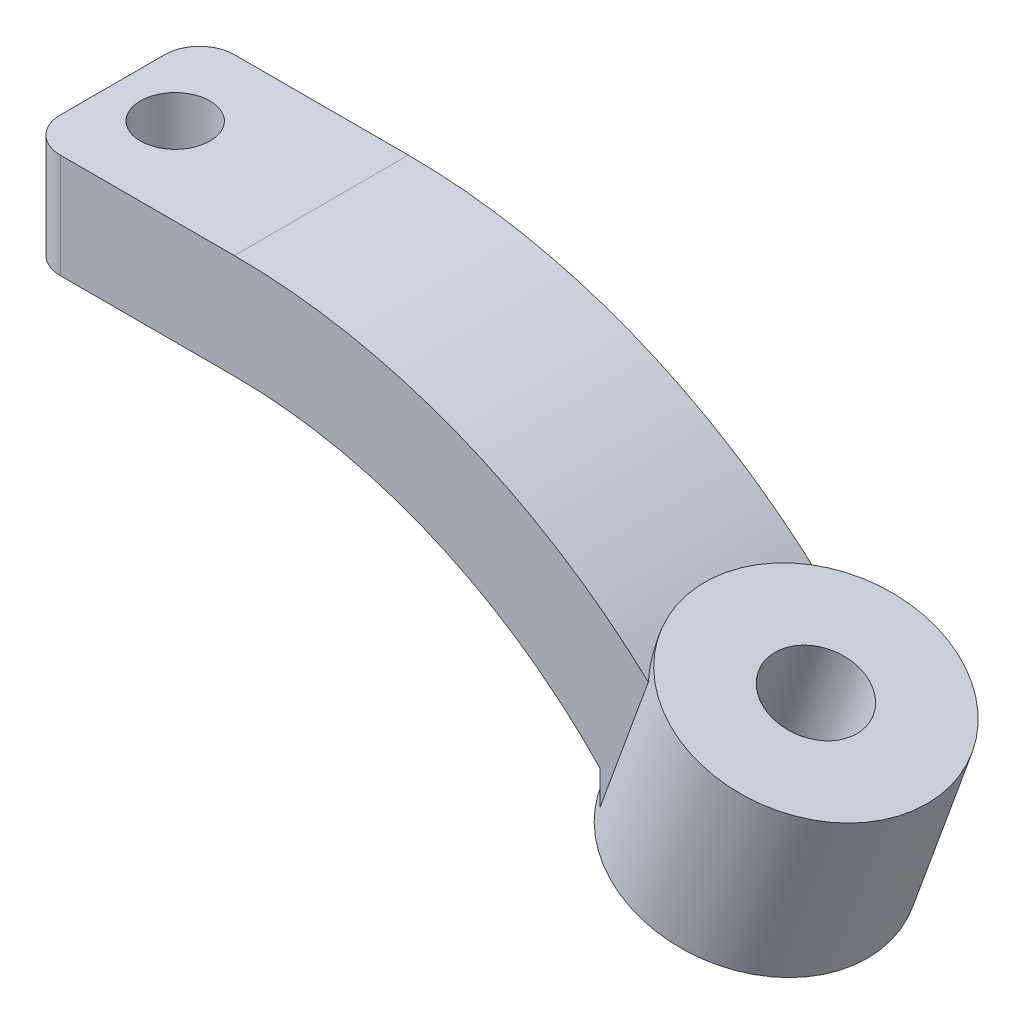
from build123d import *

# Parameters (mm, degrees)
EXTRUDE_1_DEPTH     = 2.5
SKETCH_4_R          = 1
CUT_EXTRUDE_1_DEPTH = 5
EXTRUDE_2_DEPTH     = 2.5
SKETCH_7_R          = 3.39705755
EXTRUDE_3_DEPTH     = 5
SKETCH_8_R          = 1.25
CUT_EXTRUDE_2_DEPTH = 5
FILLET_1_R          = 1


with BuildPart() as part:
    # Sketch 2 → Extrude 1 (new, symmetric)
    with BuildSketch(Plane.XY):
        with BuildLine():
            Line((3, 1.5), (-3, 1.5))
            Line((-3, 1.5), (-3, -1.5))
            Line((-3, -1.5), (3, -1.5))
            ThreePointArc((3, -1.5), (8.712563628, -2.672383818), (13.50159668, -6))
            Line((13.50159668, -6), (17.363352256, -6))
            ThreePointArc((17.363352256, -6), (11.101788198, -0.48788083), (3, 1.5))
        make_face()
    extrude(amount=EXTRUDE_1_DEPTH, both=True)

    # Sketch 4 → Cut-Extrude 1 (cut)
    with BuildSketch(Plane.XZ.offset(1.5)):
        with Locations((-1.2, 0)):
            Circle(SKETCH_4_R)
    extrude(amount=-CUT_EXTRUDE_1_DEPTH, mode=Mode.SUBTRACT)

    # Sketch 5 → Extrude 2 (add, symmetric)
    with BuildSketch(Plane.XY):
        with BuildLine():
            Line((17.660699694, -9.013789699), (13.50159668, -7.5))
            Line((13.50159668, -7.5), (13.50159668, -6))
            Line((13.50159668, -6), (17.363352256, -6))
            ThreePointArc((17.363352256, -6), (17.85486395, -7.473069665), (17.660699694, -9.013789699))
        make_face()
    extrude(amount=EXTRUDE_2_DEPTH, both=True)

    # Sketch 7 → Extrude 3 (add)
    with BuildSketch(Plane(origin=(-0.831066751, -2.283337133, 0), x_dir=(0.9396926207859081, -0.3420201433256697, 0), z_dir=(-0.34202014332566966, -0.939692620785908, 0))):
        with Locations((17.378526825, 0)):
            Circle(SKETCH_7_R)
    extrude(amount=-EXTRUDE_3_DEPTH)

    # Sketch 8 → Cut-Extrude 2 (cut)
    with BuildSketch(Plane(origin=(-0.831066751, -2.283337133, 0), x_dir=(0.9396926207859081, -0.3420201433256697, 0), z_dir=(-0.34202014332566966, -0.939692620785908, 0))):
        with Locations((17.378526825, 0)):
            Circle(SKETCH_8_R)
    extrude(amount=-CUT_EXTRUDE_2_DEPTH, mode=Mode.SUBTRACT)

    # Fillet 1
    fillet_1_edges = [part.edges().sort_by_distance(p)[0] for p in [
        (-3, 0, 2.5),
        (-3, 0, -2.5),
    ]]
    fillet(fillet_1_edges, radius=FILLET_1_R)


solid = part.part
